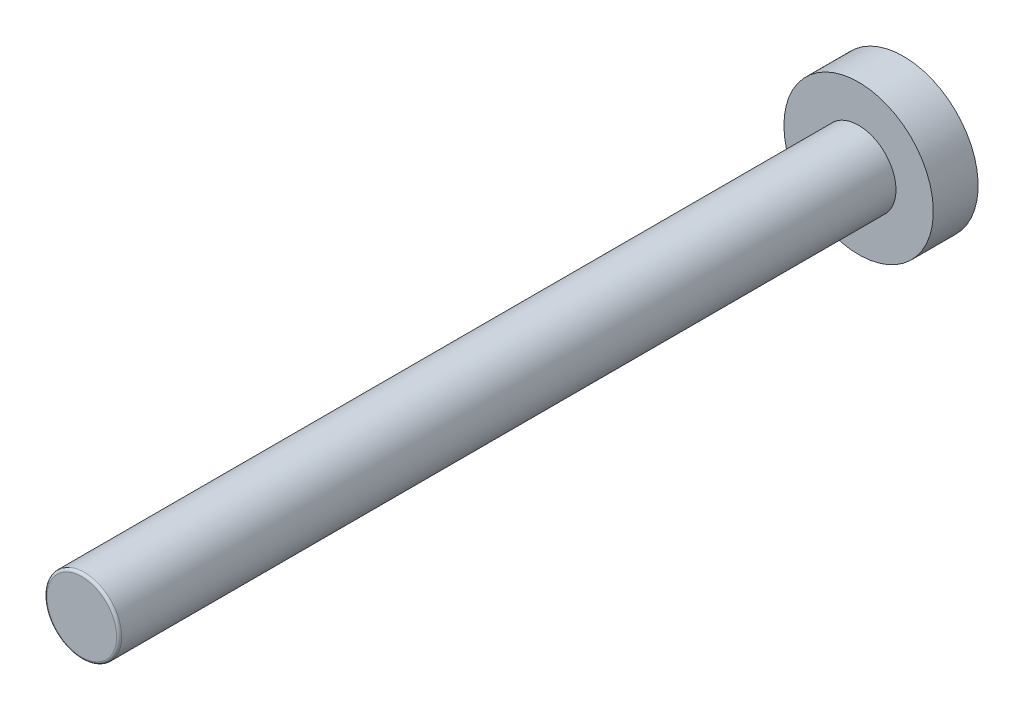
from build123d import *

# Parameters (mm, degrees)
CROQUIS2_R              = 5
SALIENTE_EXTRUIR1_DEPTH = 3


with BuildPart() as part:
    # Croquis1 → Revoluci_n1 (revolve)
    with BuildSketch(Plane(origin=(0, 0, 0), x_dir=(1, 0, 0), z_dir=(0, 1, 0))):
        with BuildLine():
            Line((2.329721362, -0.340557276), (0, -0.340557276))
            Line((0, -0.340557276), (0, -55.340557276))
            Line((0, -55.340557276), (2.329721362, -55.340557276))
            ThreePointArc((2.329721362, -55.340557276), (2.450126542, -55.290683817), (2.5, -55.170278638))
            Line((2.5, -55.170278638), (2.5, -0.510835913))
            ThreePointArc((2.5, -0.510835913), (2.450126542, -0.390430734), (2.329721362, -0.340557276))
        make_face()
    revolve(axis=Axis((0, 0, -0.002108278), (0, 0, 1)))

    # Croquis2 → Saliente-Extruir1 (add)
    with BuildSketch(Plane(origin=(0, 0, 0.340557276), x_dir=(-1, 0, 0), z_dir=(0, 0, -1))):
        Circle(CROQUIS2_R)
    extrude(amount=-SALIENTE_EXTRUIR1_DEPTH)


solid = part.part
